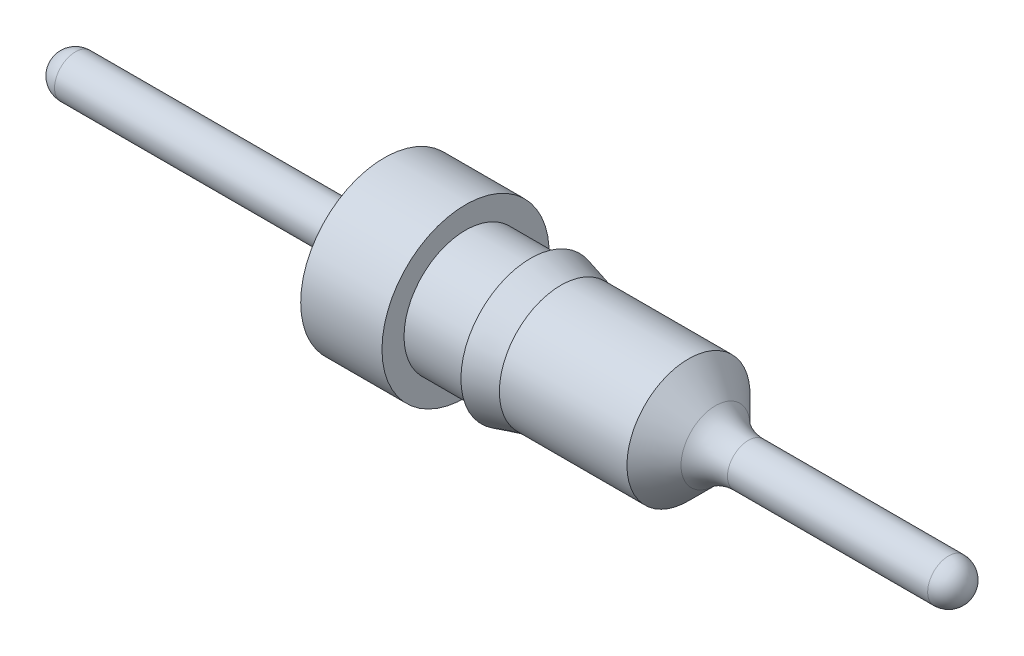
ISO-10303-21;
HEADER;
FILE_DESCRIPTION(('STEP AP214'),'2;1');
FILE_NAME('part.step','',(''),(''),'','','');
FILE_SCHEMA(('AUTOMOTIVE_DESIGN { 1 0 10303 214 1 1 1 1 }'));
ENDSEC;
DATA;
#1=APPLICATION_CONTEXT('core data for automotive mechanical design processes');
#2=APPLICATION_PROTOCOL_DEFINITION('international standard','automotive_design',2000,#1);
#3=PRODUCT_CONTEXT('',#1,'mechanical');
#4=PRODUCT('Part','Part','',(#3));
#5=PRODUCT_RELATED_PRODUCT_CATEGORY('part','',(#4));
#6=PRODUCT_DEFINITION_FORMATION('','',#4);
#7=PRODUCT_DEFINITION_CONTEXT('part definition',#1,'design');
#8=PRODUCT_DEFINITION('design','',#6,#7);
#9=PRODUCT_DEFINITION_SHAPE('','',#8);
#10=(LENGTH_UNIT() NAMED_UNIT(*) SI_UNIT(.MILLI.,.METRE.));
#11=(NAMED_UNIT(*) PLANE_ANGLE_UNIT() SI_UNIT($,.RADIAN.));
#12=(NAMED_UNIT(*) SI_UNIT($,.STERADIAN.) SOLID_ANGLE_UNIT());
#13=UNCERTAINTY_MEASURE_WITH_UNIT(LENGTH_MEASURE(1.E-05),#10,'distance_accuracy_value','');
#14=(GEOMETRIC_REPRESENTATION_CONTEXT(3) GLOBAL_UNCERTAINTY_ASSIGNED_CONTEXT((#13)) GLOBAL_UNIT_ASSIGNED_CONTEXT((#10,
#11,#12)) REPRESENTATION_CONTEXT('',''));
#15=CARTESIAN_POINT('',(0.,0.,0.));
#16=DIRECTION('',(0.,0.,1.));
#17=DIRECTION('',(1.,0.,0.));
#18=AXIS2_PLACEMENT_3D('',#15,#16,#17);
#19=CARTESIAN_POINT('',(4.49579999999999,0.914400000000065,0.));
#20=DIRECTION('',(-1.,0.,0.));
#21=DIRECTION('',(0.,0.,1.));
#22=AXIS2_PLACEMENT_3D('',#19,#20,#21);
#23=PLANE('',#22);
#24=CARTESIAN_POINT('',(4.49579999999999,0.,0.));
#25=DIRECTION('',(-1.,0.,0.));
#26=DIRECTION('',(0.,0.,1.));
#27=AXIS2_PLACEMENT_3D('',#24,#25,#26);
#28=CIRCLE('',#27,0.914400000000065);
#29=CARTESIAN_POINT('',(4.49579999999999,0.,0.914400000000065));
#30=VERTEX_POINT('',#29);
#31=EDGE_CURVE('E9',#30,#30,#28,.T.);
#32=ORIENTED_EDGE('',*,*,#31,.F.);
#33=EDGE_LOOP('',(#32));
#34=FACE_BOUND('',#33,.T.);
#35=CARTESIAN_POINT('',(4.49579999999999,0.,0.));
#36=DIRECTION('',(-1.,0.,0.));
#37=DIRECTION('',(0.,0.,1.));
#38=AXIS2_PLACEMENT_3D('',#35,#36,#37);
#39=CIRCLE('',#38,0.673100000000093);
#40=CARTESIAN_POINT('',(4.49579999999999,0.,0.673100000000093));
#41=VERTEX_POINT('',#40);
#42=EDGE_CURVE('E57',#41,#41,#39,.T.);
#43=ORIENTED_EDGE('',*,*,#42,.T.);
#44=EDGE_LOOP('',(#43));
#45=FACE_BOUND('',#44,.T.);
#46=ADVANCED_FACE('F14',(#34,#45),#23,.F.);
#47=CARTESIAN_POINT('',(0.,0.,0.));
#48=DIRECTION('',(-1.,0.,0.));
#49=DIRECTION('',(0.,0.,1.));
#50=AXIS2_PLACEMENT_3D('',#47,#48,#49);
#51=CYLINDRICAL_SURFACE('',#50,0.914400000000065);
#52=CARTESIAN_POINT('',(3.60679999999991,0.,0.));
#53=DIRECTION('',(-1.,0.,0.));
#54=DIRECTION('',(0.,0.,1.));
#55=AXIS2_PLACEMENT_3D('',#52,#53,#54);
#56=CIRCLE('',#55,0.914400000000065);
#57=CARTESIAN_POINT('',(3.60679999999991,0.,0.914400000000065));
#58=VERTEX_POINT('',#57);
#59=EDGE_CURVE('E20',#58,#58,#56,.T.);
#60=ORIENTED_EDGE('',*,*,#59,.F.);
#61=EDGE_LOOP('',(#60));
#62=FACE_BOUND('',#61,.T.);
#63=ORIENTED_EDGE('',*,*,#31,.T.);
#64=EDGE_LOOP('',(#63));
#65=FACE_BOUND('',#64,.T.);
#66=ADVANCED_FACE('F116',(#62,#65),#51,.T.);
#67=CARTESIAN_POINT('',(3.60679999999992,0.355600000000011,0.));
#68=DIRECTION('',(1.,0.,0.));
#69=DIRECTION('',(0.,0.,-1.));
#70=AXIS2_PLACEMENT_3D('',#67,#68,#69);
#71=PLANE('',#70);
#72=CARTESIAN_POINT('',(3.60679999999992,0.,0.));
#73=DIRECTION('',(-1.,0.,0.));
#74=DIRECTION('',(0.,0.,1.));
#75=AXIS2_PLACEMENT_3D('',#72,#73,#74);
#76=CIRCLE('',#75,0.355600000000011);
#77=CARTESIAN_POINT('',(3.60679999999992,0.,0.355600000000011));
#78=VERTEX_POINT('',#77);
#79=EDGE_CURVE('E24',#78,#78,#76,.T.);
#80=ORIENTED_EDGE('',*,*,#79,.F.);
#81=EDGE_LOOP('',(#80));
#82=FACE_BOUND('',#81,.T.);
#83=ORIENTED_EDGE('',*,*,#59,.T.);
#84=EDGE_LOOP('',(#83));
#85=FACE_BOUND('',#84,.T.);
#86=ADVANCED_FACE('F121',(#82,#85),#71,.F.);
#87=CARTESIAN_POINT('',(3.47979999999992,0.,0.));
#88=DIRECTION('',(-1.,0.,0.));
#89=DIRECTION('',(0.,0.,1.));
#90=AXIS2_PLACEMENT_3D('',#87,#88,#89);
#91=TOROIDAL_SURFACE('',#90,0.355600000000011,0.127000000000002);
#92=CARTESIAN_POINT('',(3.47979999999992,0.,0.));
#93=DIRECTION('',(-1.,0.,0.));
#94=DIRECTION('',(0.,0.,1.));
#95=AXIS2_PLACEMENT_3D('',#92,#93,#94);
#96=CIRCLE('',#95,0.228600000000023);
#97=CARTESIAN_POINT('',(3.47979999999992,0.,0.228600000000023));
#98=VERTEX_POINT('',#97);
#99=EDGE_CURVE('E28',#98,#98,#96,.T.);
#100=ORIENTED_EDGE('',*,*,#99,.F.);
#101=EDGE_LOOP('',(#100));
#102=FACE_BOUND('',#101,.T.);
#103=ORIENTED_EDGE('',*,*,#79,.T.);
#104=EDGE_LOOP('',(#103));
#105=FACE_BOUND('',#104,.T.);
#106=ADVANCED_FACE('F126',(#102,#105),#91,.F.);
#107=CARTESIAN_POINT('',(0.,0.,0.));
#108=DIRECTION('',(-1.,0.,0.));
#109=DIRECTION('',(0.,0.,1.));
#110=AXIS2_PLACEMENT_3D('',#107,#108,#109);
#111=CYLINDRICAL_SURFACE('',#110,0.228600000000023);
#112=CARTESIAN_POINT('',(0.228600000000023,0.,0.));
#113=DIRECTION('',(-1.,0.,0.));
#114=DIRECTION('',(0.,0.,1.));
#115=AXIS2_PLACEMENT_3D('',#112,#113,#114);
#116=CIRCLE('',#115,0.228600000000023);
#117=CARTESIAN_POINT('',(0.228600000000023,0.,0.228600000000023));
#118=VERTEX_POINT('',#117);
#119=EDGE_CURVE('E33',#118,#118,#116,.T.);
#120=ORIENTED_EDGE('',*,*,#119,.F.);
#121=EDGE_LOOP('',(#120));
#122=FACE_BOUND('',#121,.T.);
#123=ORIENTED_EDGE('',*,*,#99,.T.);
#124=EDGE_LOOP('',(#123));
#125=FACE_BOUND('',#124,.T.);
#126=ADVANCED_FACE('F112',(#122,#125),#111,.T.);
#127=CARTESIAN_POINT('',(0.228600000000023,0.,0.));
#128=DIRECTION('',(-1.,0.,0.));
#129=DIRECTION('',(0.,1.,0.));
#130=AXIS2_PLACEMENT_3D('',#127,#128,#129);
#131=SPHERICAL_SURFACE('',#130,0.228600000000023);
#132=ORIENTED_EDGE('',*,*,#119,.T.);
#133=EDGE_LOOP('',(#132));
#134=FACE_BOUND('',#133,.T.);
#135=ADVANCED_FACE('F106',(#134),#131,.T.);
#136=CARTESIAN_POINT('',(9.77900000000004,0.,0.));
#137=DIRECTION('',(-1.,0.,0.));
#138=DIRECTION('',(0.,1.,0.));
#139=AXIS2_PLACEMENT_3D('',#136,#137,#138);
#140=SPHERICAL_SURFACE('',#139,0.228600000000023);
#141=CARTESIAN_POINT('',(9.77900000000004,0.,0.));
#142=DIRECTION('',(-1.,0.,0.));
#143=DIRECTION('',(0.,0.,1.));
#144=AXIS2_PLACEMENT_3D('',#141,#142,#143);
#145=CIRCLE('',#144,0.228600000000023);
#146=CARTESIAN_POINT('',(9.77900000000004,0.,0.228600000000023));
#147=VERTEX_POINT('',#146);
#148=EDGE_CURVE('E36',#147,#147,#145,.T.);
#149=ORIENTED_EDGE('',*,*,#148,.F.);
#150=EDGE_LOOP('',(#149));
#151=FACE_BOUND('',#150,.T.);
#152=ADVANCED_FACE('F101',(#151),#140,.T.);
#153=CARTESIAN_POINT('',(0.,0.,0.));
#154=DIRECTION('',(-1.,0.,0.));
#155=DIRECTION('',(0.,0.,1.));
#156=AXIS2_PLACEMENT_3D('',#153,#154,#155);
#157=CYLINDRICAL_SURFACE('',#156,0.228600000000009);
#158=CARTESIAN_POINT('',(7.58912048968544,0.,0.));
#159=DIRECTION('',(-1.,0.,0.));
#160=DIRECTION('',(0.,0.,1.));
#161=AXIS2_PLACEMENT_3D('',#158,#159,#160);
#162=CIRCLE('',#161,0.228599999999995);
#163=CARTESIAN_POINT('',(7.58912048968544,0.,0.228599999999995));
#164=VERTEX_POINT('',#163);
#165=EDGE_CURVE('E39',#164,#164,#162,.T.);
#166=ORIENTED_EDGE('',*,*,#165,.F.);
#167=EDGE_LOOP('',(#166));
#168=FACE_BOUND('',#167,.T.);
#169=ORIENTED_EDGE('',*,*,#148,.T.);
#170=EDGE_LOOP('',(#169));
#171=FACE_BOUND('',#170,.T.);
#172=ADVANCED_FACE('F95',(#168,#171),#157,.T.);
#173=CARTESIAN_POINT('',(7.58912048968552,0.,0.));
#174=DIRECTION('',(-1.,0.,0.));
#175=DIRECTION('',(0.,0.,1.));
#176=AXIS2_PLACEMENT_3D('',#173,#174,#175);
#177=TOROIDAL_SURFACE('',#176,0.736600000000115,0.50800000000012);
#178=CARTESIAN_POINT('',(7.22991024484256,0.,0.));
#179=DIRECTION('',(-1.,0.,0.));
#180=DIRECTION('',(0.,0.,1.));
#181=AXIS2_PLACEMENT_3D('',#178,#179,#180);
#182=CIRCLE('',#181,0.377389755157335);
#183=CARTESIAN_POINT('',(7.22991024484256,0.,0.377389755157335));
#184=VERTEX_POINT('',#183);
#185=EDGE_CURVE('E42',#184,#184,#182,.T.);
#186=ORIENTED_EDGE('',*,*,#185,.F.);
#187=EDGE_LOOP('',(#186));
#188=FACE_BOUND('',#187,.T.);
#189=ORIENTED_EDGE('',*,*,#165,.T.);
#190=EDGE_LOOP('',(#189));
#191=FACE_BOUND('',#190,.T.);
#192=ADVANCED_FACE('F89',(#188,#191),#177,.F.);
#193=CARTESIAN_POINT('',(7.22991024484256,0.,0.));
#194=DIRECTION('',(-1.,0.,0.));
#195=DIRECTION('',(0.,0.,1.));
#196=AXIS2_PLACEMENT_3D('',#193,#194,#195);
#197=CONICAL_SURFACE('',#196,0.377389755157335,0.785398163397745);
#198=CARTESIAN_POINT('',(6.93419999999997,0.,0.));
#199=DIRECTION('',(-1.,0.,0.));
#200=DIRECTION('',(0.,0.,1.));
#201=AXIS2_PLACEMENT_3D('',#198,#199,#200);
#202=CIRCLE('',#201,0.673100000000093);
#203=CARTESIAN_POINT('',(6.93419999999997,0.,0.673100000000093));
#204=VERTEX_POINT('',#203);
#205=EDGE_CURVE('E45',#204,#204,#202,.T.);
#206=ORIENTED_EDGE('',*,*,#205,.F.);
#207=EDGE_LOOP('',(#206));
#208=FACE_BOUND('',#207,.T.);
#209=ORIENTED_EDGE('',*,*,#185,.T.);
#210=EDGE_LOOP('',(#209));
#211=FACE_BOUND('',#210,.T.);
#212=ADVANCED_FACE('F83',(#208,#211),#197,.T.);
#213=CARTESIAN_POINT('',(0.,0.,0.));
#214=DIRECTION('',(-1.,0.,0.));
#215=DIRECTION('',(0.,0.,1.));
#216=AXIS2_PLACEMENT_3D('',#213,#214,#215);
#217=CYLINDRICAL_SURFACE('',#216,0.673100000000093);
#218=CARTESIAN_POINT('',(5.53877931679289,0.,0.));
#219=DIRECTION('',(-1.,0.,0.));
#220=DIRECTION('',(0.,0.,1.));
#221=AXIS2_PLACEMENT_3D('',#218,#219,#220);
#222=CIRCLE('',#221,0.673100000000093);
#223=CARTESIAN_POINT('',(5.53877931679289,0.,0.673100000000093));
#224=VERTEX_POINT('',#223);
#225=EDGE_CURVE('E48',#224,#224,#222,.T.);
#226=ORIENTED_EDGE('',*,*,#225,.F.);
#227=EDGE_LOOP('',(#226));
#228=FACE_BOUND('',#227,.T.);
#229=ORIENTED_EDGE('',*,*,#205,.T.);
#230=EDGE_LOOP('',(#229));
#231=FACE_BOUND('',#230,.T.);
#232=ADVANCED_FACE('F77',(#228,#231),#217,.T.);
#233=CARTESIAN_POINT('',(5.53877931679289,0.,0.));
#234=DIRECTION('',(-1.,0.,0.));
#235=DIRECTION('',(0.,0.,1.));
#236=AXIS2_PLACEMENT_3D('',#233,#234,#235);
#237=CONICAL_SURFACE('',#236,0.673100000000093,0.261799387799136);
#238=CARTESIAN_POINT('',(5.20699999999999,0.,0.));
#239=DIRECTION('',(-1.,0.,0.));
#240=DIRECTION('',(0.,0.,1.));
#241=AXIS2_PLACEMENT_3D('',#238,#239,#240);
#242=CIRCLE('',#241,0.762000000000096);
#243=CARTESIAN_POINT('',(5.20699999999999,0.,0.762000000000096));
#244=VERTEX_POINT('',#243);
#245=EDGE_CURVE('E51',#244,#244,#242,.T.);
#246=ORIENTED_EDGE('',*,*,#245,.F.);
#247=EDGE_LOOP('',(#246));
#248=FACE_BOUND('',#247,.T.);
#249=ORIENTED_EDGE('',*,*,#225,.T.);
#250=EDGE_LOOP('',(#249));
#251=FACE_BOUND('',#250,.T.);
#252=ADVANCED_FACE('F71',(#248,#251),#237,.T.);
#253=CARTESIAN_POINT('',(5.20699999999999,0.673100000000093,0.));
#254=DIRECTION('',(1.,0.,0.));
#255=DIRECTION('',(0.,0.,-1.));
#256=AXIS2_PLACEMENT_3D('',#253,#254,#255);
#257=PLANE('',#256);
#258=CARTESIAN_POINT('',(5.20699999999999,0.,0.));
#259=DIRECTION('',(-1.,0.,0.));
#260=DIRECTION('',(0.,0.,1.));
#261=AXIS2_PLACEMENT_3D('',#258,#259,#260);
#262=CIRCLE('',#261,0.673100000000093);
#263=CARTESIAN_POINT('',(5.20699999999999,0.,0.673100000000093));
#264=VERTEX_POINT('',#263);
#265=EDGE_CURVE('E54',#264,#264,#262,.T.);
#266=ORIENTED_EDGE('',*,*,#265,.F.);
#267=EDGE_LOOP('',(#266));
#268=FACE_BOUND('',#267,.T.);
#269=ORIENTED_EDGE('',*,*,#245,.T.);
#270=EDGE_LOOP('',(#269));
#271=FACE_BOUND('',#270,.T.);
#272=ADVANCED_FACE('F65',(#268,#271),#257,.F.);
#273=CARTESIAN_POINT('',(0.,0.,0.));
#274=DIRECTION('',(-1.,0.,0.));
#275=DIRECTION('',(0.,0.,1.));
#276=AXIS2_PLACEMENT_3D('',#273,#274,#275);
#277=CYLINDRICAL_SURFACE('',#276,0.673100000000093);
#278=ORIENTED_EDGE('',*,*,#42,.F.);
#279=EDGE_LOOP('',(#278));
#280=FACE_BOUND('',#279,.T.);
#281=ORIENTED_EDGE('',*,*,#265,.T.);
#282=EDGE_LOOP('',(#281));
#283=FACE_BOUND('',#282,.T.);
#284=ADVANCED_FACE('F62',(#280,#283),#277,.T.);
#285=CLOSED_SHELL('',(#46,#66,#86,#106,#126,#135,#152,#172,#192,#212,#232,#252,#272,#284));
#286=MANIFOLD_SOLID_BREP('B1',#285);
#287=ADVANCED_BREP_SHAPE_REPRESENTATION('',(#18,#286),#14);
#288=SHAPE_DEFINITION_REPRESENTATION(#9,#287);
ENDSEC;
END-ISO-10303-21;
